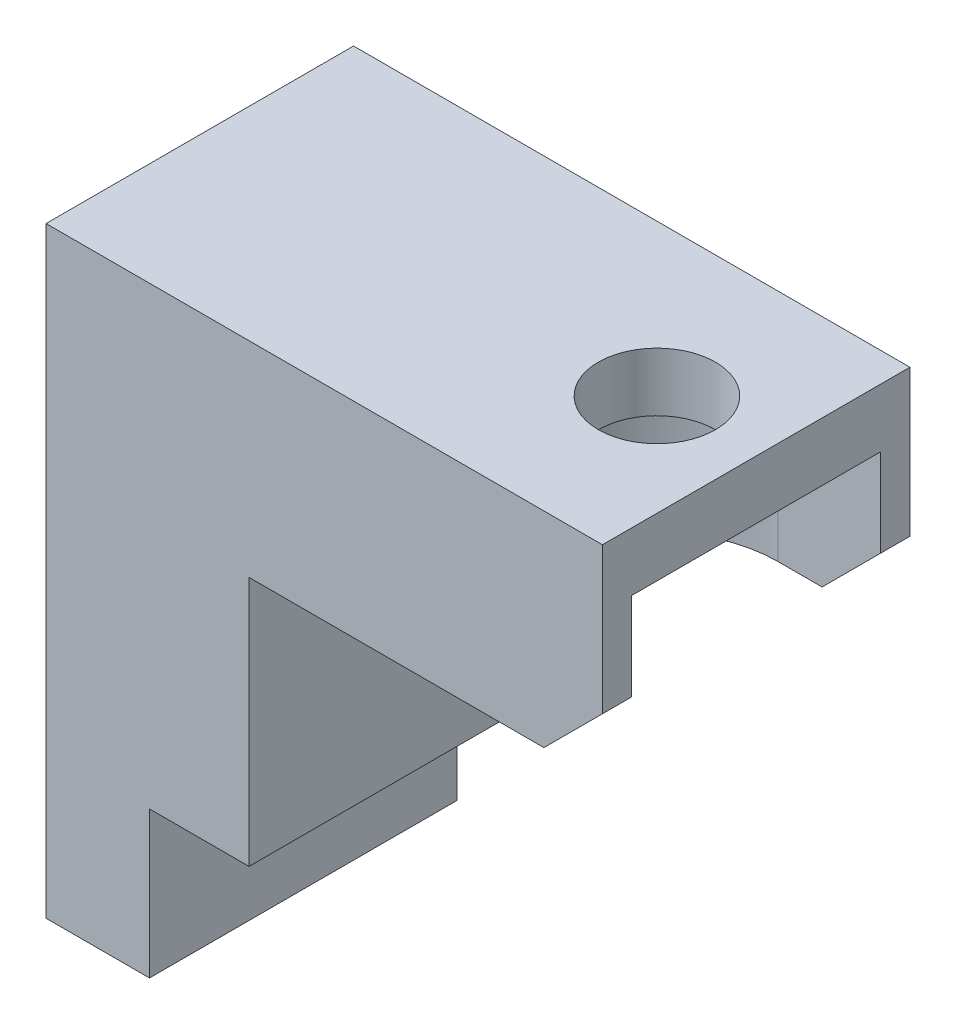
ISO-10303-21;
HEADER;
FILE_DESCRIPTION(('STEP AP214'),'2;1');
FILE_NAME('part.step','',(''),(''),'','','');
FILE_SCHEMA(('AUTOMOTIVE_DESIGN { 1 0 10303 214 1 1 1 1 }'));
ENDSEC;
DATA;
#1=APPLICATION_CONTEXT('core data for automotive mechanical design processes');
#2=APPLICATION_PROTOCOL_DEFINITION('international standard','automotive_design',2000,#1);
#3=PRODUCT_CONTEXT('',#1,'mechanical');
#4=PRODUCT('Part','Part','',(#3));
#5=PRODUCT_RELATED_PRODUCT_CATEGORY('part','',(#4));
#6=PRODUCT_DEFINITION_FORMATION('','',#4);
#7=PRODUCT_DEFINITION_CONTEXT('part definition',#1,'design');
#8=PRODUCT_DEFINITION('design','',#6,#7);
#9=PRODUCT_DEFINITION_SHAPE('','',#8);
#10=(LENGTH_UNIT() NAMED_UNIT(*) SI_UNIT(.MILLI.,.METRE.));
#11=(NAMED_UNIT(*) PLANE_ANGLE_UNIT() SI_UNIT($,.RADIAN.));
#12=(NAMED_UNIT(*) SI_UNIT($,.STERADIAN.) SOLID_ANGLE_UNIT());
#13=UNCERTAINTY_MEASURE_WITH_UNIT(LENGTH_MEASURE(1.E-05),#10,'distance_accuracy_value','');
#14=(GEOMETRIC_REPRESENTATION_CONTEXT(3) GLOBAL_UNCERTAINTY_ASSIGNED_CONTEXT((#13)) GLOBAL_UNIT_ASSIGNED_CONTEXT((#10,
#11,#12)) REPRESENTATION_CONTEXT('',''));
#15=CARTESIAN_POINT('',(0.,0.,0.));
#16=DIRECTION('',(0.,0.,1.));
#17=DIRECTION('',(1.,0.,0.));
#18=AXIS2_PLACEMENT_3D('',#15,#16,#17);
#19=CARTESIAN_POINT('',(-67.7875988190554,35.4526071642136,5.25));
#20=DIRECTION('',(-1.,0.,0.));
#21=DIRECTION('',(0.,-1.,0.));
#22=AXIS2_PLACEMENT_3D('',#19,#20,#21);
#23=PLANE('',#22);
#24=DIRECTION('',(0.,0.,-1.));
#25=VECTOR('',#24,1.);
#26=CARTESIAN_POINT('',(-67.7875988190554,44.,5.25));
#27=LINE('',#26,#25);
#28=CARTESIAN_POINT('',(-67.7875988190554,44.,5.25));
#29=VERTEX_POINT('',#28);
#30=CARTESIAN_POINT('',(-67.7875988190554,44.,-5.25));
#31=VERTEX_POINT('',#30);
#32=EDGE_CURVE('E167',#29,#31,#27,.T.);
#33=ORIENTED_EDGE('',*,*,#32,.F.);
#34=DIRECTION('',(0.,1.,0.));
#35=VECTOR('',#34,1.);
#36=CARTESIAN_POINT('',(-67.7875988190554,35.4526071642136,5.25));
#37=LINE('',#36,#35);
#38=CARTESIAN_POINT('',(-67.7875988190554,35.4526071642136,5.25));
#39=VERTEX_POINT('',#38);
#40=EDGE_CURVE('E188',#39,#29,#37,.T.);
#41=ORIENTED_EDGE('',*,*,#40,.F.);
#42=DIRECTION('',(0.,0.,-1.));
#43=VECTOR('',#42,1.);
#44=CARTESIAN_POINT('',(-67.7875988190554,35.4526071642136,5.25));
#45=LINE('',#44,#43);
#46=CARTESIAN_POINT('',(-67.7875988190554,35.4526071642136,-5.25));
#47=VERTEX_POINT('',#46);
#48=EDGE_CURVE('E219',#39,#47,#45,.T.);
#49=ORIENTED_EDGE('',*,*,#48,.T.);
#50=DIRECTION('',(0.,1.,0.));
#51=VECTOR('',#50,1.);
#52=CARTESIAN_POINT('',(-67.7875988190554,35.4526071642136,-5.25));
#53=LINE('',#52,#51);
#54=EDGE_CURVE('E173',#47,#31,#53,.T.);
#55=ORIENTED_EDGE('',*,*,#54,.T.);
#56=EDGE_LOOP('',(#33,#41,#49,#55));
#57=FACE_BOUND('',#56,.T.);
#58=ADVANCED_FACE('F33',(#57),#23,.F.);
#59=CARTESIAN_POINT('',(-55.7192964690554,49.,5.25));
#60=DIRECTION('',(0.,1.,0.));
#61=DIRECTION('',(0.,0.,1.));
#62=AXIS2_PLACEMENT_3D('',#59,#60,#61);
#63=PLANE('',#62);
#64=CARTESIAN_POINT('',(-59.1908650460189,49.,-0.081564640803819));
#65=DIRECTION('',(0.,1.,0.));
#66=DIRECTION('',(0.,0.,1.));
#67=AXIS2_PLACEMENT_3D('',#64,#65,#66);
#68=CIRCLE('',#67,2.);
#69=CARTESIAN_POINT('',(-59.1908650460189,49.,1.91843535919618));
#70=VERTEX_POINT('',#69);
#71=EDGE_CURVE('E283',#70,#70,#68,.F.);
#72=ORIENTED_EDGE('',*,*,#71,.F.);
#73=EDGE_LOOP('',(#72));
#74=FACE_BOUND('',#73,.T.);
#75=DIRECTION('',(-1.,0.,0.));
#76=VECTOR('',#75,1.);
#77=CARTESIAN_POINT('',(-55.7192964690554,49.,-4.25));
#78=LINE('',#77,#76);
#79=CARTESIAN_POINT('',(-55.7192964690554,49.,-4.25));
#80=VERTEX_POINT('',#79);
#81=CARTESIAN_POINT('',(-59.2192964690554,49.,-4.25));
#82=VERTEX_POINT('',#81);
#83=EDGE_CURVE('E149',#80,#82,#78,.T.);
#84=ORIENTED_EDGE('',*,*,#83,.F.);
#85=DIRECTION('',(0.,0.,-1.));
#86=VECTOR('',#85,1.);
#87=CARTESIAN_POINT('',(-55.7192964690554,49.,5.25));
#88=LINE('',#87,#86);
#89=CARTESIAN_POINT('',(-55.7192964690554,49.,4.25));
#90=VERTEX_POINT('',#89);
#91=EDGE_CURVE('E216',#90,#80,#88,.T.);
#92=ORIENTED_EDGE('',*,*,#91,.F.);
#93=DIRECTION('',(1.,0.,0.));
#94=VECTOR('',#93,1.);
#95=CARTESIAN_POINT('',(-55.7192964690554,49.,4.25));
#96=LINE('',#95,#94);
#97=CARTESIAN_POINT('',(-59.2192964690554,49.,4.25));
#98=VERTEX_POINT('',#97);
#99=EDGE_CURVE('E276',#98,#90,#96,.T.);
#100=ORIENTED_EDGE('',*,*,#99,.F.);
#101=CARTESIAN_POINT('',(-59.2192964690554,49.,0.));
#102=DIRECTION('',(0.,1.,0.));
#103=DIRECTION('',(0.,0.,1.));
#104=AXIS2_PLACEMENT_3D('',#101,#102,#103);
#105=CIRCLE('',#104,4.25);
#106=EDGE_CURVE('E280',#82,#98,#105,.T.);
#107=ORIENTED_EDGE('',*,*,#106,.F.);
#108=EDGE_LOOP('',(#84,#92,#100,#107));
#109=FACE_BOUND('',#108,.T.);
#110=ADVANCED_FACE('F301',(#74,#109),#63,.F.);
#111=CARTESIAN_POINT('',(-71.1875988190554,35.4526071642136,5.25));
#112=DIRECTION('',(0.,1.,0.));
#113=DIRECTION('',(0.,0.,1.));
#114=AXIS2_PLACEMENT_3D('',#111,#112,#113);
#115=PLANE('',#114);
#116=DIRECTION('',(1.,0.,0.));
#117=VECTOR('',#116,1.);
#118=CARTESIAN_POINT('',(-71.1875988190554,35.4526071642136,-5.25));
#119=LINE('',#118,#117);
#120=CARTESIAN_POINT('',(-71.1875988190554,35.4526071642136,-5.25));
#121=VERTEX_POINT('',#120);
#122=EDGE_CURVE('E170',#121,#47,#119,.T.);
#123=ORIENTED_EDGE('',*,*,#122,.T.);
#124=ORIENTED_EDGE('',*,*,#48,.F.);
#125=DIRECTION('',(1.,0.,0.));
#126=VECTOR('',#125,1.);
#127=CARTESIAN_POINT('',(-71.1875988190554,35.4526071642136,5.25));
#128=LINE('',#127,#126);
#129=CARTESIAN_POINT('',(-71.1875988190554,35.4526071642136,5.25));
#130=VERTEX_POINT('',#129);
#131=EDGE_CURVE('E185',#130,#39,#128,.T.);
#132=ORIENTED_EDGE('',*,*,#131,.F.);
#133=DIRECTION('',(0.,0.,-1.));
#134=VECTOR('',#133,1.);
#135=CARTESIAN_POINT('',(-71.1875988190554,35.4526071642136,5.25));
#136=LINE('',#135,#134);
#137=EDGE_CURVE('E201',#130,#121,#136,.T.);
#138=ORIENTED_EDGE('',*,*,#137,.T.);
#139=EDGE_LOOP('',(#123,#124,#132,#138));
#140=FACE_BOUND('',#139,.T.);
#141=ADVANCED_FACE('F35',(#140),#115,.F.);
#142=CARTESIAN_POINT('',(-55.7192964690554,51.,5.25));
#143=DIRECTION('',(-1.,0.,0.));
#144=DIRECTION('',(0.,0.,1.));
#145=AXIS2_PLACEMENT_3D('',#142,#143,#144);
#146=PLANE('',#145);
#147=DIRECTION('',(0.,1.,0.));
#148=VECTOR('',#147,1.);
#149=CARTESIAN_POINT('',(-55.7192964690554,51.,5.25));
#150=LINE('',#149,#148);
#151=CARTESIAN_POINT('',(-55.7192964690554,46.,5.25));
#152=VERTEX_POINT('',#151);
#153=CARTESIAN_POINT('',(-55.7192964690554,51.,5.25));
#154=VERTEX_POINT('',#153);
#155=EDGE_CURVE('E191',#152,#154,#150,.T.);
#156=ORIENTED_EDGE('',*,*,#155,.F.);
#157=DIRECTION('',(0.,0.,-1.));
#158=VECTOR('',#157,1.);
#159=CARTESIAN_POINT('',(-55.7192964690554,46.,5.25));
#160=LINE('',#159,#158);
#161=CARTESIAN_POINT('',(-55.7192964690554,46.,4.25));
#162=VERTEX_POINT('',#161);
#163=EDGE_CURVE('E55',#152,#162,#160,.T.);
#164=ORIENTED_EDGE('',*,*,#163,.T.);
#165=DIRECTION('',(0.,1.,0.));
#166=VECTOR('',#165,1.);
#167=CARTESIAN_POINT('',(-55.7192964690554,44.,4.25));
#168=LINE('',#167,#166);
#169=EDGE_CURVE('E160',#162,#90,#168,.T.);
#170=ORIENTED_EDGE('',*,*,#169,.T.);
#171=ORIENTED_EDGE('',*,*,#91,.T.);
#172=DIRECTION('',(0.,1.,0.));
#173=VECTOR('',#172,1.);
#174=CARTESIAN_POINT('',(-55.7192964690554,44.,-4.25));
#175=LINE('',#174,#173);
#176=CARTESIAN_POINT('',(-55.7192964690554,46.,-4.25));
#177=VERTEX_POINT('',#176);
#178=EDGE_CURVE('E152',#177,#80,#175,.T.);
#179=ORIENTED_EDGE('',*,*,#178,.F.);
#180=DIRECTION('',(0.,0.,-1.));
#181=VECTOR('',#180,1.);
#182=CARTESIAN_POINT('',(-55.7192964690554,46.,5.25));
#183=LINE('',#182,#181);
#184=CARTESIAN_POINT('',(-55.7192964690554,46.,-5.25));
#185=VERTEX_POINT('',#184);
#186=EDGE_CURVE('E228',#177,#185,#183,.T.);
#187=ORIENTED_EDGE('',*,*,#186,.T.);
#188=DIRECTION('',(0.,1.,0.));
#189=VECTOR('',#188,1.);
#190=CARTESIAN_POINT('',(-55.7192964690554,51.,-5.25));
#191=LINE('',#190,#189);
#192=CARTESIAN_POINT('',(-55.7192964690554,51.,-5.25));
#193=VERTEX_POINT('',#192);
#194=EDGE_CURVE('E175',#185,#193,#191,.T.);
#195=ORIENTED_EDGE('',*,*,#194,.T.);
#196=DIRECTION('',(0.,0.,-1.));
#197=VECTOR('',#196,1.);
#198=CARTESIAN_POINT('',(-55.7192964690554,51.,5.25));
#199=LINE('',#198,#197);
#200=EDGE_CURVE('E213',#154,#193,#199,.T.);
#201=ORIENTED_EDGE('',*,*,#200,.F.);
#202=EDGE_LOOP('',(#156,#164,#170,#171,#179,#187,#195,#201));
#203=FACE_BOUND('',#202,.T.);
#204=ADVANCED_FACE('F244',(#203),#146,.F.);
#205=CARTESIAN_POINT('',(-55.7192964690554,51.,5.25));
#206=DIRECTION('',(0.,-1.,0.));
#207=DIRECTION('',(0.,0.,-1.));
#208=AXIS2_PLACEMENT_3D('',#205,#206,#207);
#209=PLANE('',#208);
#210=CARTESIAN_POINT('',(-59.1908650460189,51.,-0.081564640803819));
#211=DIRECTION('',(0.,1.,0.));
#212=DIRECTION('',(0.,0.,1.));
#213=AXIS2_PLACEMENT_3D('',#210,#211,#212);
#214=CIRCLE('',#213,2.);
#215=CARTESIAN_POINT('',(-59.1908650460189,51.,1.91843535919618));
#216=VERTEX_POINT('',#215);
#217=EDGE_CURVE('E286',#216,#216,#214,.T.);
#218=ORIENTED_EDGE('',*,*,#217,.F.);
#219=EDGE_LOOP('',(#218));
#220=FACE_BOUND('',#219,.T.);
#221=DIRECTION('',(-1.,0.,0.));
#222=VECTOR('',#221,1.);
#223=CARTESIAN_POINT('',(-55.7192964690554,51.,-5.25));
#224=LINE('',#223,#222);
#225=CARTESIAN_POINT('',(-74.7192964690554,51.,-5.25));
#226=VERTEX_POINT('',#225);
#227=EDGE_CURVE('E177',#193,#226,#224,.T.);
#228=ORIENTED_EDGE('',*,*,#227,.T.);
#229=DIRECTION('',(0.,0.,-1.));
#230=VECTOR('',#229,1.);
#231=CARTESIAN_POINT('',(-74.7192964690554,51.,5.25));
#232=LINE('',#231,#230);
#233=CARTESIAN_POINT('',(-74.7192964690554,51.,5.25));
#234=VERTEX_POINT('',#233);
#235=EDGE_CURVE('E210',#234,#226,#232,.T.);
#236=ORIENTED_EDGE('',*,*,#235,.F.);
#237=DIRECTION('',(-1.,0.,0.));
#238=VECTOR('',#237,1.);
#239=CARTESIAN_POINT('',(-55.7192964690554,51.,5.25));
#240=LINE('',#239,#238);
#241=EDGE_CURVE('E193',#154,#234,#240,.T.);
#242=ORIENTED_EDGE('',*,*,#241,.F.);
#243=ORIENTED_EDGE('',*,*,#200,.T.);
#244=EDGE_LOOP('',(#228,#236,#242,#243));
#245=FACE_BOUND('',#244,.T.);
#246=ADVANCED_FACE('F250',(#220,#245),#209,.F.);
#247=CARTESIAN_POINT('',(-74.7192964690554,51.,5.25));
#248=DIRECTION('',(1.,0.,0.));
#249=DIRECTION('',(0.,0.,-1.));
#250=AXIS2_PLACEMENT_3D('',#247,#248,#249);
#251=PLANE('',#250);
#252=DIRECTION('',(0.,-1.,0.));
#253=VECTOR('',#252,1.);
#254=CARTESIAN_POINT('',(-74.7192964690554,51.,-5.25));
#255=LINE('',#254,#253);
#256=CARTESIAN_POINT('',(-74.7192964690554,30.4526071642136,-5.25));
#257=VERTEX_POINT('',#256);
#258=EDGE_CURVE('E179',#226,#257,#255,.T.);
#259=ORIENTED_EDGE('',*,*,#258,.T.);
#260=DIRECTION('',(0.,0.,-1.));
#261=VECTOR('',#260,1.);
#262=CARTESIAN_POINT('',(-74.7192964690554,30.4526071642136,5.25));
#263=LINE('',#262,#261);
#264=CARTESIAN_POINT('',(-74.7192964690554,30.4526071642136,5.25));
#265=VERTEX_POINT('',#264);
#266=EDGE_CURVE('E207',#265,#257,#263,.T.);
#267=ORIENTED_EDGE('',*,*,#266,.F.);
#268=DIRECTION('',(0.,-1.,0.));
#269=VECTOR('',#268,1.);
#270=CARTESIAN_POINT('',(-74.7192964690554,51.,5.25));
#271=LINE('',#270,#269);
#272=EDGE_CURVE('E195',#234,#265,#271,.T.);
#273=ORIENTED_EDGE('',*,*,#272,.F.);
#274=ORIENTED_EDGE('',*,*,#235,.T.);
#275=EDGE_LOOP('',(#259,#267,#273,#274));
#276=FACE_BOUND('',#275,.T.);
#277=ADVANCED_FACE('F256',(#276),#251,.F.);
#278=CARTESIAN_POINT('',(-71.1875988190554,30.4526071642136,5.25));
#279=DIRECTION('',(0.,1.,0.));
#280=DIRECTION('',(0.,0.,1.));
#281=AXIS2_PLACEMENT_3D('',#278,#279,#280);
#282=PLANE('',#281);
#283=DIRECTION('',(1.,0.,0.));
#284=VECTOR('',#283,1.);
#285=CARTESIAN_POINT('',(-71.1875988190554,30.4526071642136,-5.25));
#286=LINE('',#285,#284);
#287=CARTESIAN_POINT('',(-71.1875988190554,30.4526071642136,-5.25));
#288=VERTEX_POINT('',#287);
#289=EDGE_CURVE('E181',#257,#288,#286,.T.);
#290=ORIENTED_EDGE('',*,*,#289,.T.);
#291=DIRECTION('',(0.,0.,-1.));
#292=VECTOR('',#291,1.);
#293=CARTESIAN_POINT('',(-71.1875988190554,30.4526071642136,5.25));
#294=LINE('',#293,#292);
#295=CARTESIAN_POINT('',(-71.1875988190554,30.4526071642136,5.25));
#296=VERTEX_POINT('',#295);
#297=EDGE_CURVE('E204',#296,#288,#294,.T.);
#298=ORIENTED_EDGE('',*,*,#297,.F.);
#299=DIRECTION('',(1.,0.,0.));
#300=VECTOR('',#299,1.);
#301=CARTESIAN_POINT('',(-71.1875988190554,30.4526071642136,5.25));
#302=LINE('',#301,#300);
#303=EDGE_CURVE('E197',#265,#296,#302,.T.);
#304=ORIENTED_EDGE('',*,*,#303,.F.);
#305=ORIENTED_EDGE('',*,*,#266,.T.);
#306=EDGE_LOOP('',(#290,#298,#304,#305));
#307=FACE_BOUND('',#306,.T.);
#308=ADVANCED_FACE('F260',(#307),#282,.F.);
#309=CARTESIAN_POINT('',(-71.1875988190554,35.4526071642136,5.25));
#310=DIRECTION('',(-1.,0.,0.));
#311=DIRECTION('',(0.,0.,1.));
#312=AXIS2_PLACEMENT_3D('',#309,#310,#311);
#313=PLANE('',#312);
#314=DIRECTION('',(0.,1.,0.));
#315=VECTOR('',#314,1.);
#316=CARTESIAN_POINT('',(-71.1875988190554,35.4526071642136,-5.25));
#317=LINE('',#316,#315);
#318=EDGE_CURVE('E183',#288,#121,#317,.T.);
#319=ORIENTED_EDGE('',*,*,#318,.T.);
#320=ORIENTED_EDGE('',*,*,#137,.F.);
#321=DIRECTION('',(0.,1.,0.));
#322=VECTOR('',#321,1.);
#323=CARTESIAN_POINT('',(-71.1875988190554,35.4526071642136,5.25));
#324=LINE('',#323,#322);
#325=EDGE_CURVE('E199',#296,#130,#324,.T.);
#326=ORIENTED_EDGE('',*,*,#325,.F.);
#327=ORIENTED_EDGE('',*,*,#297,.T.);
#328=EDGE_LOOP('',(#319,#320,#326,#327));
#329=FACE_BOUND('',#328,.T.);
#330=ADVANCED_FACE('F265',(#329),#313,.F.);
#331=CARTESIAN_POINT('',(-55.7192964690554,35.4526071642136,5.25));
#332=DIRECTION('',(0.,0.,-1.));
#333=DIRECTION('',(-1.,0.,0.));
#334=AXIS2_PLACEMENT_3D('',#331,#332,#333);
#335=PLANE('',#334);
#336=DIRECTION('',(-1.,0.,0.));
#337=VECTOR('',#336,1.);
#338=CARTESIAN_POINT('',(-55.7192964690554,44.,5.25));
#339=LINE('',#338,#337);
#340=CARTESIAN_POINT('',(-57.7192964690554,44.,5.25));
#341=VERTEX_POINT('',#340);
#342=EDGE_CURVE('E243',#341,#29,#339,.T.);
#343=ORIENTED_EDGE('',*,*,#342,.F.);
#344=DIRECTION('',(-0.707106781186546,-0.707106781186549,0.));
#345=VECTOR('',#344,1.);
#346=CARTESIAN_POINT('',(-57.7192964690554,44.,5.25));
#347=LINE('',#346,#345);
#348=EDGE_CURVE('E226',#341,#152,#347,.F.);
#349=ORIENTED_EDGE('',*,*,#348,.T.);
#350=ORIENTED_EDGE('',*,*,#155,.T.);
#351=ORIENTED_EDGE('',*,*,#241,.T.);
#352=ORIENTED_EDGE('',*,*,#272,.T.);
#353=ORIENTED_EDGE('',*,*,#303,.T.);
#354=ORIENTED_EDGE('',*,*,#325,.T.);
#355=ORIENTED_EDGE('',*,*,#131,.T.);
#356=ORIENTED_EDGE('',*,*,#40,.T.);
#357=EDGE_LOOP('',(#343,#349,#350,#351,#352,#353,#354,#355,#356));
#358=FACE_BOUND('',#357,.T.);
#359=ADVANCED_FACE('F241',(#358),#335,.F.);
#360=CARTESIAN_POINT('',(-55.7192964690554,35.4526071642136,-5.25));
#361=DIRECTION('',(0.,0.,-1.));
#362=DIRECTION('',(-1.,0.,0.));
#363=AXIS2_PLACEMENT_3D('',#360,#361,#362);
#364=PLANE('',#363);
#365=ORIENTED_EDGE('',*,*,#194,.F.);
#366=DIRECTION('',(0.707106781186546,0.707106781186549,0.));
#367=VECTOR('',#366,1.);
#368=CARTESIAN_POINT('',(-60.9929928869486,40.7263035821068,-5.25));
#369=LINE('',#368,#367);
#370=CARTESIAN_POINT('',(-57.7192964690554,44.,-5.25));
#371=VERTEX_POINT('',#370);
#372=EDGE_CURVE('E11',#185,#371,#369,.F.);
#373=ORIENTED_EDGE('',*,*,#372,.T.);
#374=DIRECTION('',(1.,0.,0.));
#375=VECTOR('',#374,1.);
#376=CARTESIAN_POINT('',(-55.7192964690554,44.,-5.25));
#377=LINE('',#376,#375);
#378=EDGE_CURVE('E142',#31,#371,#377,.T.);
#379=ORIENTED_EDGE('',*,*,#378,.F.);
#380=ORIENTED_EDGE('',*,*,#54,.F.);
#381=ORIENTED_EDGE('',*,*,#122,.F.);
#382=ORIENTED_EDGE('',*,*,#318,.F.);
#383=ORIENTED_EDGE('',*,*,#289,.F.);
#384=ORIENTED_EDGE('',*,*,#258,.F.);
#385=ORIENTED_EDGE('',*,*,#227,.F.);
#386=EDGE_LOOP('',(#365,#373,#379,#380,#381,#382,#383,#384,#385));
#387=FACE_BOUND('',#386,.T.);
#388=ADVANCED_FACE('F274',(#387),#364,.T.);
#389=CARTESIAN_POINT('',(-59.2192964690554,44.,0.));
#390=DIRECTION('',(0.,1.,0.));
#391=DIRECTION('',(0.,0.,1.));
#392=AXIS2_PLACEMENT_3D('',#389,#390,#391);
#393=PLANE('',#392);
#394=DIRECTION('',(1.,0.,0.));
#395=VECTOR('',#394,1.);
#396=CARTESIAN_POINT('',(-55.7192964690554,44.,4.25));
#397=LINE('',#396,#395);
#398=CARTESIAN_POINT('',(-59.2192964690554,44.,4.25));
#399=VERTEX_POINT('',#398);
#400=CARTESIAN_POINT('',(-57.7192964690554,44.,4.25));
#401=VERTEX_POINT('',#400);
#402=EDGE_CURVE('E158',#399,#401,#397,.T.);
#403=ORIENTED_EDGE('',*,*,#402,.T.);
#404=DIRECTION('',(0.,0.,1.));
#405=VECTOR('',#404,1.);
#406=CARTESIAN_POINT('',(-57.7192964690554,44.,0.));
#407=LINE('',#406,#405);
#408=EDGE_CURVE('E223',#401,#341,#407,.T.);
#409=ORIENTED_EDGE('',*,*,#408,.T.);
#410=ORIENTED_EDGE('',*,*,#342,.T.);
#411=ORIENTED_EDGE('',*,*,#32,.T.);
#412=ORIENTED_EDGE('',*,*,#378,.T.);
#413=DIRECTION('',(0.,0.,1.));
#414=VECTOR('',#413,1.);
#415=CARTESIAN_POINT('',(-57.7192964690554,44.,0.));
#416=LINE('',#415,#414);
#417=CARTESIAN_POINT('',(-57.7192964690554,44.,-4.25));
#418=VERTEX_POINT('',#417);
#419=EDGE_CURVE('E141',#371,#418,#416,.T.);
#420=ORIENTED_EDGE('',*,*,#419,.T.);
#421=DIRECTION('',(-1.,0.,0.));
#422=VECTOR('',#421,1.);
#423=CARTESIAN_POINT('',(-55.7192964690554,44.,-4.25));
#424=LINE('',#423,#422);
#425=CARTESIAN_POINT('',(-59.2192964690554,44.,-4.25));
#426=VERTEX_POINT('',#425);
#427=EDGE_CURVE('E132',#418,#426,#424,.T.);
#428=ORIENTED_EDGE('',*,*,#427,.T.);
#429=CARTESIAN_POINT('',(-59.2192964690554,44.,0.));
#430=DIRECTION('',(0.,1.,0.));
#431=DIRECTION('',(0.,0.,1.));
#432=AXIS2_PLACEMENT_3D('',#429,#430,#431);
#433=CIRCLE('',#432,4.25);
#434=EDGE_CURVE('E137',#426,#399,#433,.T.);
#435=ORIENTED_EDGE('',*,*,#434,.T.);
#436=EDGE_LOOP('',(#403,#409,#410,#411,#412,#420,#428,#435));
#437=FACE_BOUND('',#436,.T.);
#438=ADVANCED_FACE('F135',(#437),#393,.F.);
#439=CARTESIAN_POINT('',(-55.7192964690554,44.,-4.25));
#440=DIRECTION('',(0.,0.,-1.));
#441=DIRECTION('',(-1.,0.,0.));
#442=AXIS2_PLACEMENT_3D('',#439,#440,#441);
#443=PLANE('',#442);
#444=ORIENTED_EDGE('',*,*,#427,.F.);
#445=DIRECTION('',(-0.707106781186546,-0.707106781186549,0.));
#446=VECTOR('',#445,1.);
#447=CARTESIAN_POINT('',(-57.7192964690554,44.,-4.25));
#448=LINE('',#447,#446);
#449=EDGE_CURVE('E41',#418,#177,#448,.F.);
#450=ORIENTED_EDGE('',*,*,#449,.T.);
#451=ORIENTED_EDGE('',*,*,#178,.T.);
#452=ORIENTED_EDGE('',*,*,#83,.T.);
#453=DIRECTION('',(0.,1.,0.));
#454=VECTOR('',#453,1.);
#455=CARTESIAN_POINT('',(-59.2192964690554,44.,-4.25));
#456=LINE('',#455,#454);
#457=EDGE_CURVE('E146',#426,#82,#456,.T.);
#458=ORIENTED_EDGE('',*,*,#457,.F.);
#459=EDGE_LOOP('',(#444,#450,#451,#452,#458));
#460=FACE_BOUND('',#459,.T.);
#461=ADVANCED_FACE('F147',(#460),#443,.F.);
#462=CARTESIAN_POINT('',(-59.2192964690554,44.,0.));
#463=DIRECTION('',(0.,1.,0.));
#464=DIRECTION('',(0.,0.,1.));
#465=AXIS2_PLACEMENT_3D('',#462,#463,#464);
#466=CYLINDRICAL_SURFACE('',#465,4.25);
#467=ORIENTED_EDGE('',*,*,#106,.T.);
#468=DIRECTION('',(0.,1.,0.));
#469=VECTOR('',#468,1.);
#470=CARTESIAN_POINT('',(-59.2192964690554,44.,4.25));
#471=LINE('',#470,#469);
#472=EDGE_CURVE('E153',#399,#98,#471,.T.);
#473=ORIENTED_EDGE('',*,*,#472,.F.);
#474=ORIENTED_EDGE('',*,*,#434,.F.);
#475=ORIENTED_EDGE('',*,*,#457,.T.);
#476=EDGE_LOOP('',(#467,#473,#474,#475));
#477=FACE_BOUND('',#476,.T.);
#478=ADVANCED_FACE('F155',(#477),#466,.F.);
#479=CARTESIAN_POINT('',(-55.7192964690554,44.,4.25));
#480=DIRECTION('',(0.,0.,1.));
#481=DIRECTION('',(1.,0.,0.));
#482=AXIS2_PLACEMENT_3D('',#479,#480,#481);
#483=PLANE('',#482);
#484=ORIENTED_EDGE('',*,*,#169,.F.);
#485=DIRECTION('',(0.707106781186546,0.707106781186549,0.));
#486=VECTOR('',#485,1.);
#487=CARTESIAN_POINT('',(-57.7192964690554,44.,4.25));
#488=LINE('',#487,#486);
#489=EDGE_CURVE('E231',#162,#401,#488,.F.);
#490=ORIENTED_EDGE('',*,*,#489,.T.);
#491=ORIENTED_EDGE('',*,*,#402,.F.);
#492=ORIENTED_EDGE('',*,*,#472,.T.);
#493=ORIENTED_EDGE('',*,*,#99,.T.);
#494=EDGE_LOOP('',(#484,#490,#491,#492,#493));
#495=FACE_BOUND('',#494,.T.);
#496=ADVANCED_FACE('F234',(#495),#483,.F.);
#497=CARTESIAN_POINT('',(-59.1908650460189,43.3431457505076,-0.081564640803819));
#498=DIRECTION('',(0.,1.,0.));
#499=DIRECTION('',(0.,0.,1.));
#500=AXIS2_PLACEMENT_3D('',#497,#498,#499);
#501=CYLINDRICAL_SURFACE('',#500,2.);
#502=CARTESIAN_POINT('',(-59.1908650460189,49.,1.91843535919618));
#503=CARTESIAN_POINT('',(-59.1908650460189,49.0208333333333,1.91843535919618));
#504=CARTESIAN_POINT('',(-59.1908650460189,49.0416666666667,1.91843535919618));
#505=CARTESIAN_POINT('',(-59.1908650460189,49.0833333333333,1.91843535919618));
#506=CARTESIAN_POINT('',(-59.1908650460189,49.1041666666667,1.91843535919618));
#507=CARTESIAN_POINT('',(-59.1908650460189,49.1458333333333,1.91843535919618));
#508=CARTESIAN_POINT('',(-59.1908650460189,49.1666666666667,1.91843535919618));
#509=CARTESIAN_POINT('',(-59.1908650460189,49.2083333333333,1.91843535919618));
#510=CARTESIAN_POINT('',(-59.1908650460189,49.2291666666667,1.91843535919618));
#511=CARTESIAN_POINT('',(-59.1908650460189,49.2708333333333,1.91843535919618));
#512=CARTESIAN_POINT('',(-59.1908650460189,49.2916666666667,1.91843535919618));
#513=CARTESIAN_POINT('',(-59.1908650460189,49.3333333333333,1.91843535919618));
#514=CARTESIAN_POINT('',(-59.1908650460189,49.3541666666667,1.91843535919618));
#515=CARTESIAN_POINT('',(-59.1908650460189,49.3958333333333,1.91843535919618));
#516=CARTESIAN_POINT('',(-59.1908650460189,49.4166666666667,1.91843535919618));
#517=CARTESIAN_POINT('',(-59.1908650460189,49.4583333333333,1.91843535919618));
#518=CARTESIAN_POINT('',(-59.1908650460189,49.4791666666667,1.91843535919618));
#519=CARTESIAN_POINT('',(-59.1908650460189,49.5208333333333,1.91843535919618));
#520=CARTESIAN_POINT('',(-59.1908650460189,49.5416666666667,1.91843535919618));
#521=CARTESIAN_POINT('',(-59.1908650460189,49.5833333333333,1.91843535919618));
#522=CARTESIAN_POINT('',(-59.1908650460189,49.6041666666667,1.91843535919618));
#523=CARTESIAN_POINT('',(-59.1908650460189,49.6458333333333,1.91843535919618));
#524=CARTESIAN_POINT('',(-59.1908650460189,49.6666666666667,1.91843535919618));
#525=CARTESIAN_POINT('',(-59.1908650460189,49.7083333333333,1.91843535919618));
#526=CARTESIAN_POINT('',(-59.1908650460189,49.7291666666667,1.91843535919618));
#527=CARTESIAN_POINT('',(-59.1908650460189,49.7708333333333,1.91843535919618));
#528=CARTESIAN_POINT('',(-59.1908650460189,49.7916666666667,1.91843535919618));
#529=CARTESIAN_POINT('',(-59.1908650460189,49.8333333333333,1.91843535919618));
#530=CARTESIAN_POINT('',(-59.1908650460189,49.8541666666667,1.91843535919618));
#531=CARTESIAN_POINT('',(-59.1908650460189,49.8958333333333,1.91843535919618));
#532=CARTESIAN_POINT('',(-59.1908650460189,49.9166666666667,1.91843535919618));
#533=CARTESIAN_POINT('',(-59.1908650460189,49.9583333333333,1.91843535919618));
#534=CARTESIAN_POINT('',(-59.1908650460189,49.9791666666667,1.91843535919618));
#535=CARTESIAN_POINT('',(-59.1908650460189,50.0208333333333,1.91843535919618));
#536=CARTESIAN_POINT('',(-59.1908650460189,50.0416666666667,1.91843535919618));
#537=CARTESIAN_POINT('',(-59.1908650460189,50.0833333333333,1.91843535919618));
#538=CARTESIAN_POINT('',(-59.1908650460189,50.1041666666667,1.91843535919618));
#539=CARTESIAN_POINT('',(-59.1908650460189,50.1458333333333,1.91843535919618));
#540=CARTESIAN_POINT('',(-59.1908650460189,50.1666666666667,1.91843535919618));
#541=CARTESIAN_POINT('',(-59.1908650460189,50.2083333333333,1.91843535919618));
#542=CARTESIAN_POINT('',(-59.1908650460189,50.2291666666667,1.91843535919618));
#543=CARTESIAN_POINT('',(-59.1908650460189,50.2708333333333,1.91843535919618));
#544=CARTESIAN_POINT('',(-59.1908650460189,50.2916666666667,1.91843535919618));
#545=CARTESIAN_POINT('',(-59.1908650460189,50.3333333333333,1.91843535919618));
#546=CARTESIAN_POINT('',(-59.1908650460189,50.3541666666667,1.91843535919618));
#547=CARTESIAN_POINT('',(-59.1908650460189,50.3958333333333,1.91843535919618));
#548=CARTESIAN_POINT('',(-59.1908650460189,50.4166666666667,1.91843535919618));
#549=CARTESIAN_POINT('',(-59.1908650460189,50.4583333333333,1.91843535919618));
#550=CARTESIAN_POINT('',(-59.1908650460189,50.4791666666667,1.91843535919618));
#551=CARTESIAN_POINT('',(-59.1908650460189,50.5208333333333,1.91843535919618));
#552=CARTESIAN_POINT('',(-59.1908650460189,50.5416666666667,1.91843535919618));
#553=CARTESIAN_POINT('',(-59.1908650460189,50.5833333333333,1.91843535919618));
#554=CARTESIAN_POINT('',(-59.1908650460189,50.6041666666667,1.91843535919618));
#555=CARTESIAN_POINT('',(-59.1908650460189,50.6458333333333,1.91843535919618));
#556=CARTESIAN_POINT('',(-59.1908650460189,50.6666666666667,1.91843535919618));
#557=CARTESIAN_POINT('',(-59.1908650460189,50.7083333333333,1.91843535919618));
#558=CARTESIAN_POINT('',(-59.1908650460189,50.7291666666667,1.91843535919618));
#559=CARTESIAN_POINT('',(-59.1908650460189,50.7708333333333,1.91843535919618));
#560=CARTESIAN_POINT('',(-59.1908650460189,50.7916666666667,1.91843535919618));
#561=CARTESIAN_POINT('',(-59.1908650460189,50.8333333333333,1.91843535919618));
#562=CARTESIAN_POINT('',(-59.1908650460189,50.8541666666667,1.91843535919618));
#563=CARTESIAN_POINT('',(-59.1908650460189,50.8958333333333,1.91843535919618));
#564=CARTESIAN_POINT('',(-59.1908650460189,50.9166666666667,1.91843535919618));
#565=CARTESIAN_POINT('',(-59.1908650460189,50.9583333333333,1.91843535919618));
#566=CARTESIAN_POINT('',(-59.1908650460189,50.9791666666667,1.91843535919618));
#567=CARTESIAN_POINT('',(-59.1908650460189,51.,1.91843535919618));
#568=B_SPLINE_CURVE_WITH_KNOTS('',3,(#502,#503,#504,#505,#506,#507,#508,#509,#510,#511,#512,
#513,#514,#515,#516,#517,#518,#519,#520,#521,#522,#523,#524,#525,#526,#527,#528,#529,#530,#531,
#532,#533,#534,#535,#536,#537,#538,#539,#540,#541,#542,#543,#544,#545,#546,#547,#548,#549,#550,
#551,#552,#553,#554,#555,#556,#557,#558,#559,#560,#561,#562,#563,#564,#565,#566,#567),
.UNSPECIFIED.,.F.,.F.,(4,2,2,2,2,2,2,2,2,2,2,2,2,2,2,2,2,2,2,2,2,2,2,2,2,2,2,2,2,2,2,2,4),(0.,
0.0625000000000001,0.125,0.1875,0.25,0.3125,0.375,0.4375,0.5,0.5625,0.625000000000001,
0.687500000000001,0.750000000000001,0.812500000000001,0.875000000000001,0.937500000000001,1.,
1.0625,1.125,1.1875,1.25,1.3125,1.375,1.4375,1.5,1.5625,1.625,1.6875,1.75,1.8125,1.875,1.9375,
2.),.UNSPECIFIED.);
#569=EDGE_CURVE('BSEAM290',#70,#216,#568,.T.);
#570=ORIENTED_EDGE('',*,*,#71,.T.);
#571=ORIENTED_EDGE('',*,*,#217,.T.);
#572=ORIENTED_EDGE('',*,*,#569,.T.);
#573=ORIENTED_EDGE('',*,*,#569,.F.);
#574=EDGE_LOOP('',(#570,#572,#571,#573));
#575=FACE_BOUND('',#574,.T.);
#576=ADVANCED_FACE('F290',(#575),#501,.F.);
#577=CARTESIAN_POINT('',(-57.7192964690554,44.,0.));
#578=DIRECTION('',(-0.707106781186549,0.707106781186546,0.));
#579=DIRECTION('',(-0.707106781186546,-0.707106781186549,0.));
#580=AXIS2_PLACEMENT_3D('',#577,#578,#579);
#581=PLANE('',#580);
#582=ORIENTED_EDGE('',*,*,#489,.F.);
#583=ORIENTED_EDGE('',*,*,#163,.F.);
#584=ORIENTED_EDGE('',*,*,#348,.F.);
#585=ORIENTED_EDGE('',*,*,#408,.F.);
#586=EDGE_LOOP('',(#582,#583,#584,#585));
#587=FACE_BOUND('',#586,.T.);
#588=ADVANCED_FACE('F239',(#587),#581,.F.);
#589=CARTESIAN_POINT('',(-57.7192964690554,44.,0.));
#590=DIRECTION('',(-0.707106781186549,0.707106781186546,0.));
#591=DIRECTION('',(-0.707106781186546,-0.707106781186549,0.));
#592=AXIS2_PLACEMENT_3D('',#589,#590,#591);
#593=PLANE('',#592);
#594=ORIENTED_EDGE('',*,*,#372,.F.);
#595=ORIENTED_EDGE('',*,*,#186,.F.);
#596=ORIENTED_EDGE('',*,*,#449,.F.);
#597=ORIENTED_EDGE('',*,*,#419,.F.);
#598=EDGE_LOOP('',(#594,#595,#596,#597));
#599=FACE_BOUND('',#598,.T.);
#600=ADVANCED_FACE('F315',(#599),#593,.F.);
#601=CLOSED_SHELL('',(#58,#110,#141,#204,#246,#277,#308,#330,#359,#388,#438,#461,#478,#496,#576,
#588,#600));
#602=MANIFOLD_SOLID_BREP('B2',#601);
#603=ADVANCED_BREP_SHAPE_REPRESENTATION('',(#18,#602),#14);
#604=SHAPE_DEFINITION_REPRESENTATION(#9,#603);
ENDSEC;
END-ISO-10303-21;
